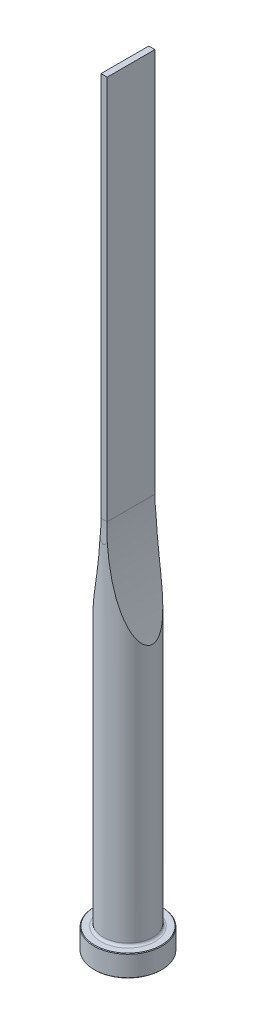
from build123d import *

# Parameters (mm, degrees)
CUT_EXTRUDE1_DEPTH = 10
CUT_EXTRUDE2_DEPTH = 10


with BuildPart() as part:
    # Sketch1 → Revolve1 (revolve)
    with BuildSketch(Plane.XY, mode=Mode.PRIVATE) as revolve1_sk:
        with BuildLine():
            Line((0, 0), (10.8, 0))
            Line((10.8, 0), (11, 0.2))
            Line((11, 0.2), (11, 6.8))
            Line((11, 6.8), (10.8, 7))
            Line((10.8, 7), (8.8, 7))
            ThreePointArc((8.8, 7), (8.234314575, 7.234314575), (8, 7.8))
            Line((8, 7.8), (8, 250))
            Line((8, 250), (0, 250))
            Line((0, 250), (0, 0))
        make_face()
    revolve(revolve1_sk.sketch.rotate(Axis((0, 250, 0), (0, -1, 0)), 180), axis=Axis((0, 250, 0), (0, -1, 0)))

    # Sketch2 → Cut-Extrude1 (cut, symmetric)
    with BuildSketch(Plane.XY):
        with BuildLine():
            Line((1, 250), (1, 125))
            ThreePointArc((1, 125), (2.767352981, 107.251760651), (8, 90.200574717))
            Line((8, 90.200574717), (8, 250))
            Line((8, 250), (1, 250))
        make_face()
        with BuildLine():
            Line((-1, 250), (-1, 125))
            ThreePointArc((-1, 125), (-2.767352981, 107.251760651), (-8, 90.200574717))
            Line((-8, 90.200574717), (-8, 250))
            Line((-8, 250), (-1, 250))
        make_face()
    extrude(amount=CUT_EXTRUDE1_DEPTH, both=True, mode=Mode.SUBTRACT)

    # Sketch3 → Cut-Extrude2 (cut, symmetric)
    with BuildSketch(Plane(origin=(0, 0, 0), x_dir=(0, 0, -1), z_dir=(1, 0, 0))):
        with BuildLine():
            Line((7.75, 250), (7.75, 125))
            ThreePointArc((7.75, 125), (7.812521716, 121.645898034), (8, 118.296456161))
            Line((8, 118.296456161), (8, 250))
            Line((8, 250), (7.75, 250))
        make_face()
        with BuildLine():
            Line((-7.75, 250), (-7.75, 125))
            ThreePointArc((-7.75, 125), (-7.812521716, 121.645898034), (-8, 118.296456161))
            Line((-8, 118.296456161), (-8, 250))
            Line((-8, 250), (-7.75, 250))
        make_face()
    extrude(amount=CUT_EXTRUDE2_DEPTH, both=True, mode=Mode.SUBTRACT)


solid = part.part
